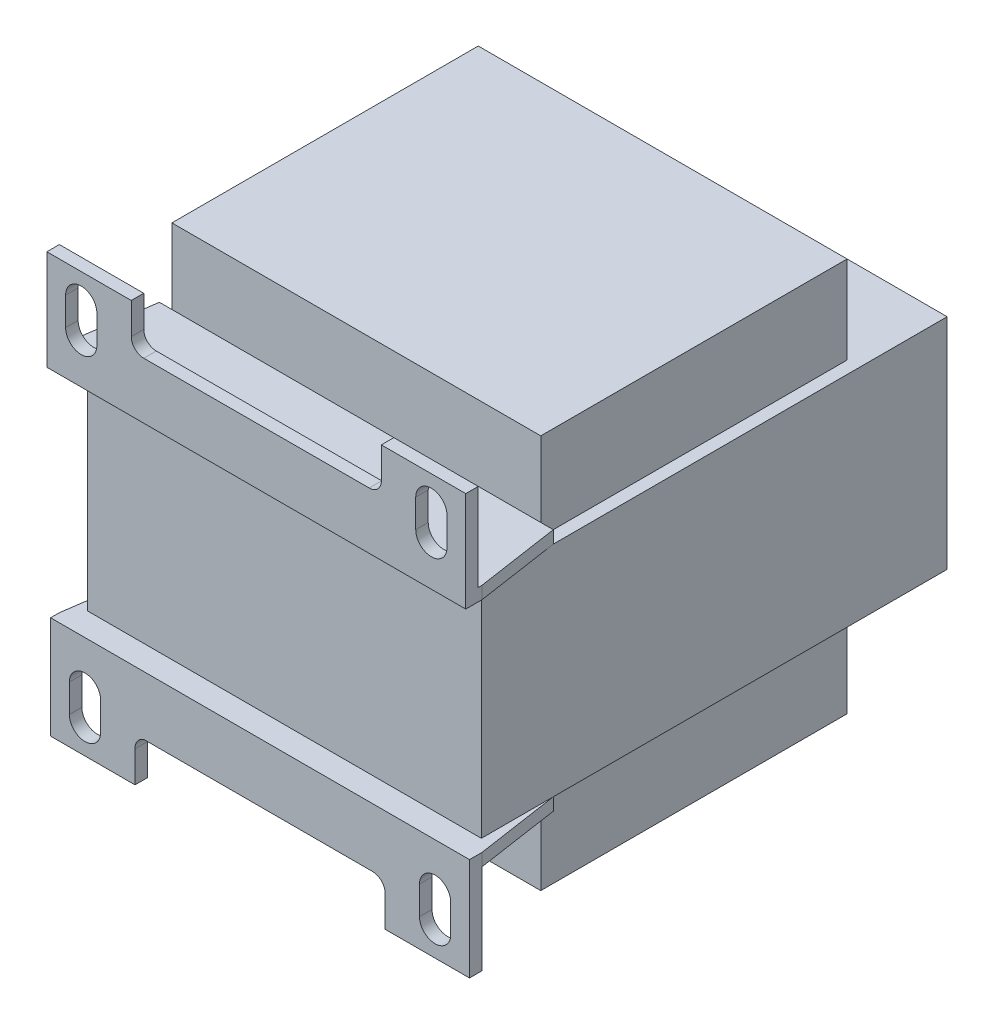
from build123d import *

# Parameters (mm, degrees)
SKICA1_W                       = 63
SKICA1_H                       = 35
P_IDAT_VYSUNUT_M1_DEPTH        = 74.5
SKICA2_W                       = 59
SKICA2_H                       = 49
P_IDAT_VYSUNUT_M2_DEPTH        = 14
SKICA3_W                       = 59
SKICA3_H                       = 49
P_IDAT_VYSUNUT_M3_DEPTH        = 14
SKICA4_W                       = 63
SKICA4_H                       = 15.4
HOLDER_TRAFA_DEPTH             = 16.4
SKICA5_W                       = 13.4
SKICA5_H                       = 14.4
ODEBRAT_VYSUNUT_M1_DEPTH       = 109.297598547
ODEBRAT_VYSUNUT_M4_DEPTH       = 95.9548892
P_IDAT_VYSUNUT_M5_DEPTH        = 2
P_IDAT_VYSUNUT_M7_DEPTH        = 2
SKICA15_W                      = 63
SKICA15_H                      = 16
P_IDAT_VYSUNUT_M10_DEPTH       = 16
SKICA16_W                      = 16
SKICA16_H                      = 16
P_IDAT_VYSUNUT_M11_DEPTH       = 2
SKICA17_W                      = 16
SKICA17_H                      = 16
P_IDAT_VYSUNUT_M12_DEPTH       = 2
SKICA18_W                      = 14
SKICA18_H                      = 14
ODEBRAT_VYSUNUT_M8_DEPTH       = 112.836707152
ODEBRAT_VYSUNUT_M11_DEPTH      = 98.136164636
ODEBRAT_VYSUNUT_M12_DEPTH      = 103.815297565
ODEBRAT_VYSUNUT_M12_DEPTH_BACK = 103.815297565
ODEBRAT_VYSUNUT_M13_DEPTH      = 104.014297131
ODEBRAT_VYSUNUT_M13_DEPTH_BACK = 104.014297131


with BuildPart() as part:
    # Skica1 → P_idat vysunut_m1 (new body)
    with BuildSketch(Plane.XY):
        with Locations((8.081070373, 8.659803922)):
            Rectangle(SKICA1_W, SKICA1_H)
    extrude(amount=P_IDAT_VYSUNUT_M1_DEPTH)

    # Skica2 → P_idat vysunut_m2 (add)
    with BuildSketch(Plane(origin=(0, 26.159803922, 0), x_dir=(1, 0, 0), z_dir=(0, 1, 0))):
        with Locations((8.081070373, -38.5)):
            Rectangle(SKICA2_W, SKICA2_H)
    extrude(amount=P_IDAT_VYSUNUT_M2_DEPTH)

    # Skica3 → P_idat vysunut_m3 (add)
    with BuildSketch(Plane(origin=(0, -8.840196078, 0), x_dir=(-1, 0, 0), z_dir=(0, -1, 0))):
        with Locations((-8.081070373, -38.5)):
            Rectangle(SKICA3_W, SKICA3_H)
    extrude(amount=P_IDAT_VYSUNUT_M3_DEPTH)

    # Skica4 → holder trafa (add)
    with BuildSketch(Plane.XZ.offset(8.840196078)):
        with Locations((8.081070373, 70.7)):
            Rectangle(SKICA4_W, SKICA4_H)
    extrude(amount=HOLDER_TRAFA_DEPTH)

    # Skica5 → Odebrat vysunut_m1 (cut, through all)
    with BuildSketch(Plane.ZY.offset(23.418929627)):
        with Locations((69.7, -18.040196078)):
            Rectangle(SKICA5_W, SKICA5_H)
    extrude(amount=-ODEBRAT_VYSUNUT_M1_DEPTH, mode=Mode.SUBTRACT)

    # Skica6 → Odebrat vysunut_m4 (cut, through all)
    with BuildSketch(Plane(origin=(0, 0, 76.4), x_dir=(-1, 0, 0), z_dir=(0, 0, -1))):
        with BuildLine():
            Line((-38.581070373, -16.240196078), (-38.581070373, -20.740196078))
            ThreePointArc((-38.581070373, -20.740196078), (-36.081070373, -23.240196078), (-33.581070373, -20.740196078))
            Line((-33.581070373, -20.740196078), (-33.581070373, -16.240196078))
            ThreePointArc((-33.581070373, -16.240196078), (-36.081070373, -13.740196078), (-38.581070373, -16.240196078))
        make_face()
        with BuildLine():
            Line((-28.081070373, -20.240196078), (-28.081070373, -25.240196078))
            Line((-28.081070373, -25.240196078), (11.918929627, -25.240196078))
            Line((11.918929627, -25.240196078), (11.918929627, -20.240196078))
            ThreePointArc((11.918929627, -20.240196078), (11.543052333, -18.991717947), (10.477596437, -18.240196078))
            Line((10.477596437, -18.240196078), (-26.081070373, -18.240196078))
            ThreePointArc((-26.081070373, -18.240196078), (-27.495283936, -18.825982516), (-28.081070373, -20.240196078))
        make_face()
        with BuildLine():
            Line((17.418929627, -16.240196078), (17.418929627, -20.740196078))
            ThreePointArc((17.418929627, -20.740196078), (19.918929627, -23.240196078), (22.418929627, -20.740196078))
            Line((22.418929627, -20.740196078), (22.418929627, -16.240196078))
            ThreePointArc((22.418929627, -16.240196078), (19.918929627, -13.740196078), (17.418929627, -16.240196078))
        make_face()
    extrude(amount=-ODEBRAT_VYSUNUT_M4_DEPTH, mode=Mode.SUBTRACT)

    # Skica7 → P_idat vysunut_m5 (add)
    with BuildSketch(Plane.ZY.offset(23.418929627)):
        Polygon((76.4, -10.840196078), (76.4, -25.240196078), (78.4, -25.240196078), (78.4, -8.840196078), (63, -8.840196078), (63, -10.840196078), align=None)
    extrude(amount=P_IDAT_VYSUNUT_M5_DEPTH)

    # Skica9 → P_idat vysunut_m7 (add)
    with BuildSketch(Plane(origin=(39.581070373, 0, 0), x_dir=(0, 0, -1), z_dir=(1, 0, 0))):
        Polygon((-63, -10.840196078), (-76.4, -10.840196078), (-76.4, -25.240196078), (-78.4, -25.240196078), (-78.4, -8.840196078), (-63, -8.840196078), align=None)
    extrude(amount=P_IDAT_VYSUNUT_M7_DEPTH)

    # Skica15 → P_idat vysunut_m10 (add)
    with BuildSketch(Plane(origin=(0, 26.159803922, 0), x_dir=(1, 0, 0), z_dir=(0, 1, 0))):
        with Locations((8.081070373, -71)):
            Rectangle(SKICA15_W, SKICA15_H)
    extrude(amount=P_IDAT_VYSUNUT_M10_DEPTH)

    # Skica16 → P_idat vysunut_m11 (add)
    with BuildSketch(Plane(origin=(39.581070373, 0, 0), x_dir=(0, 0, -1), z_dir=(1, 0, 0))):
        with Locations((-71, 34.159803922)):
            Rectangle(SKICA16_W, SKICA16_H)
    extrude(amount=P_IDAT_VYSUNUT_M11_DEPTH)

    # Skica17 → P_idat vysunut_m12 (add)
    with BuildSketch(Plane.ZY.offset(23.418929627)):
        with Locations((71, 34.159803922)):
            Rectangle(SKICA17_W, SKICA17_H)
    extrude(amount=P_IDAT_VYSUNUT_M12_DEPTH)

    # Skica18 → Odebrat vysunut_m8 (cut, through all)
    with BuildSketch(Plane.ZY.offset(25.418929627)):
        with Locations((70, 35.159803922)):
            Rectangle(SKICA18_W, SKICA18_H)
    extrude(amount=-ODEBRAT_VYSUNUT_M8_DEPTH, mode=Mode.SUBTRACT)

    # Skica21 → Odebrat vysunut_m11 (cut, through all)
    with BuildSketch(Plane(origin=(0, 0, 77), x_dir=(-1, 0, 0), z_dir=(0, 0, -1))):
        with BuildLine():
            Line((11.918929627, 37.159803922), (11.918929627, 42.159803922))
            Line((11.918929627, 42.159803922), (-28.081070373, 42.159803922))
            Line((-28.081070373, 42.159803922), (-28.081070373, 37.159803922))
            ThreePointArc((-28.081070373, 37.159803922), (-27.511173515, 35.783951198), (-26.135320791, 35.214054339))
            Line((-26.135320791, 35.214054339), (9.918929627, 35.159803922))
            ThreePointArc((9.918929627, 35.159803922), (11.333143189, 35.745590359), (11.918929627, 37.159803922))
        make_face()
        with BuildLine():
            Line((17.418929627, 37.659803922), (17.418929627, 33.159803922))
            ThreePointArc((17.418929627, 33.159803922), (19.918929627, 30.659803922), (22.418929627, 33.159803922))
            Line((22.418929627, 33.159803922), (22.418929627, 37.659803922))
            ThreePointArc((22.418929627, 37.659803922), (19.918929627, 40.159803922), (17.418929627, 37.659803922))
        make_face()
        with BuildLine():
            Line((-38.581070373, 37.659803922), (-38.581070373, 33.159803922))
            ThreePointArc((-38.581070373, 33.159803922), (-36.081070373, 30.659803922), (-33.581070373, 33.159803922))
            Line((-33.581070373, 33.159803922), (-33.581070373, 37.659803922))
            ThreePointArc((-33.581070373, 37.659803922), (-36.081070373, 40.159803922), (-38.581070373, 37.659803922))
        make_face()
    extrude(amount=-ODEBRAT_VYSUNUT_M11_DEPTH, mode=Mode.SUBTRACT)

    # Skica23 → Odebrat vysunut_m12 (cut, two sides: drawn at the far end of the back side and taken through both)
    with BuildSketch(Plane(origin=(0, -8.840196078, 0), x_dir=(1, 0, 0), z_dir=(0, 1, 0)).offset(-ODEBRAT_VYSUNUT_M12_DEPTH_BACK)):
        Polygon((41.581070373, -63), (39.581070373, -63), (41.581070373, -76.4), align=None)
    extrude(amount=ODEBRAT_VYSUNUT_M12_DEPTH + ODEBRAT_VYSUNUT_M12_DEPTH_BACK, mode=Mode.SUBTRACT)

    # Skica24 → Odebrat vysunut_m13 (cut, two sides: drawn at the far end of the back side and taken through both)
    with BuildSketch(Plane.XZ.offset(-26.159803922).offset(-ODEBRAT_VYSUNUT_M13_DEPTH_BACK)):
        Polygon((-25.418929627, 63), (-23.418929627, 63), (-25.418929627, 77), align=None)
    extrude(amount=ODEBRAT_VYSUNUT_M13_DEPTH + ODEBRAT_VYSUNUT_M13_DEPTH_BACK, mode=Mode.SUBTRACT)


solid = part.part
